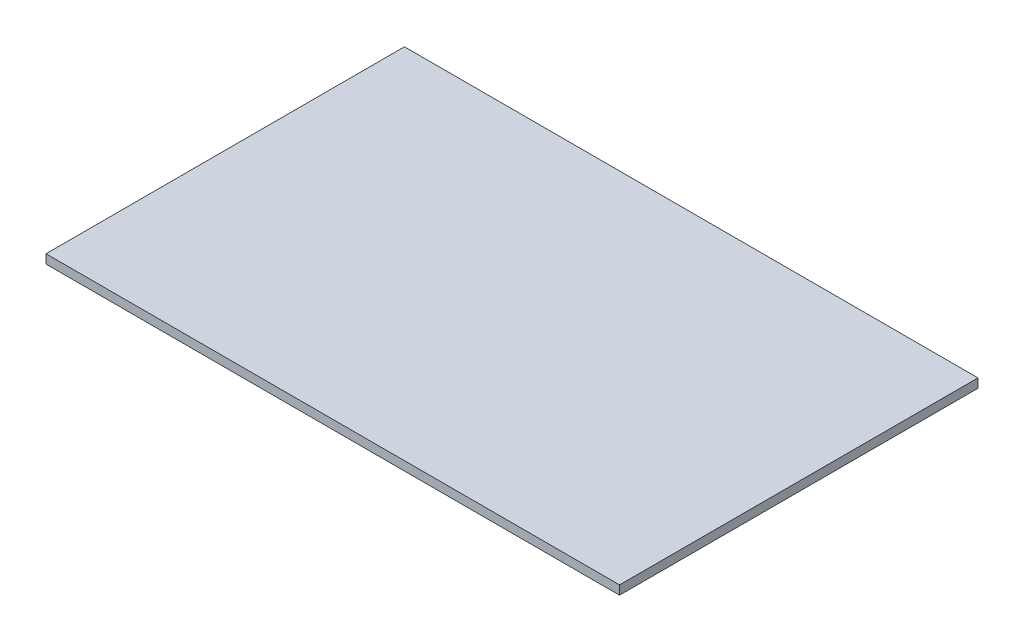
from build123d import *

# Parameters (mm, degrees)
SKETCH1_W      = 406.4
SKETCH1_H      = 254
EXTRUDE1_DEPTH = 6.35


with BuildPart() as part:
    # Sketch1 → Extrude1 (new body)
    with BuildSketch(Plane(origin=(0, 0, 0), x_dir=(1, 0, 0), z_dir=(0, 1, 0))):
        with Locations((203.2, 127)):
            Rectangle(SKETCH1_W, SKETCH1_H)
    extrude(amount=EXTRUDE1_DEPTH)


solid = part.part
